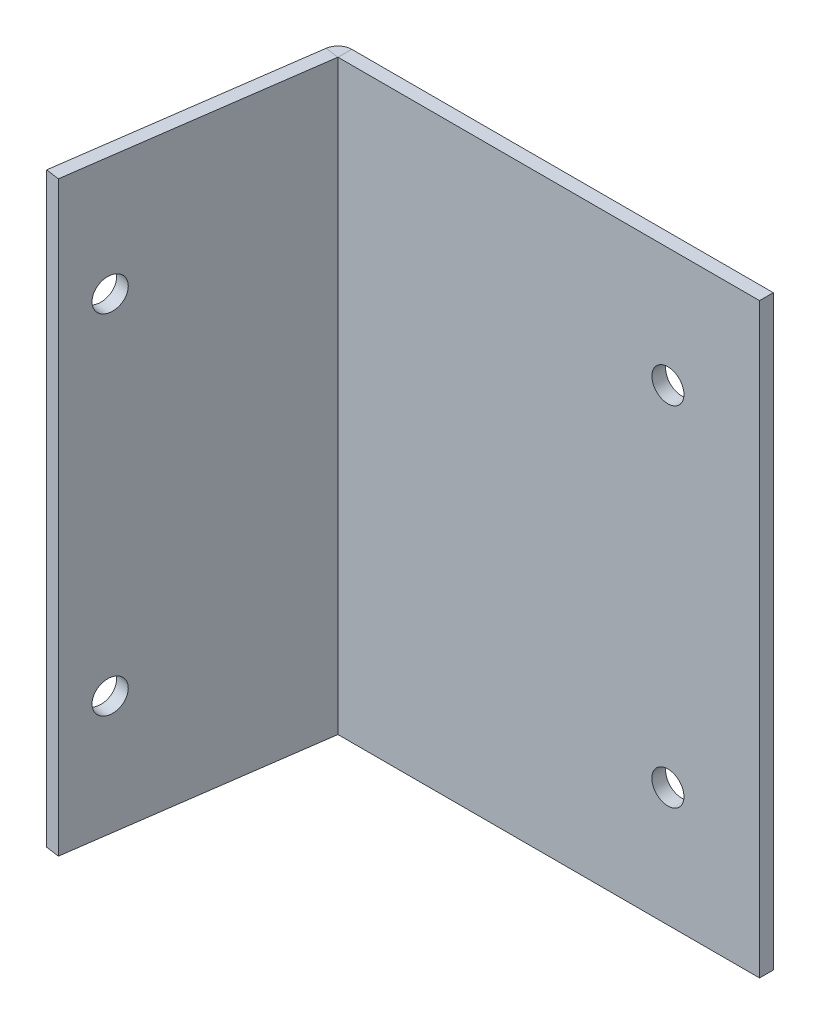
ISO-10303-21;
HEADER;
FILE_DESCRIPTION(('STEP AP214'),'2;1');
FILE_NAME('part.step','',(''),(''),'','','');
FILE_SCHEMA(('AUTOMOTIVE_DESIGN { 1 0 10303 214 1 1 1 1 }'));
ENDSEC;
DATA;
#1=APPLICATION_CONTEXT('core data for automotive mechanical design processes');
#2=APPLICATION_PROTOCOL_DEFINITION('international standard','automotive_design',2000,#1);
#3=PRODUCT_CONTEXT('',#1,'mechanical');
#4=PRODUCT('Part','Part','',(#3));
#5=PRODUCT_RELATED_PRODUCT_CATEGORY('part','',(#4));
#6=PRODUCT_DEFINITION_FORMATION('','',#4);
#7=PRODUCT_DEFINITION_CONTEXT('part definition',#1,'design');
#8=PRODUCT_DEFINITION('design','',#6,#7);
#9=PRODUCT_DEFINITION_SHAPE('','',#8);
#10=(LENGTH_UNIT() NAMED_UNIT(*) SI_UNIT(.MILLI.,.METRE.));
#11=(NAMED_UNIT(*) PLANE_ANGLE_UNIT() SI_UNIT($,.RADIAN.));
#12=(NAMED_UNIT(*) SI_UNIT($,.STERADIAN.) SOLID_ANGLE_UNIT());
#13=UNCERTAINTY_MEASURE_WITH_UNIT(LENGTH_MEASURE(1.E-05),#10,'distance_accuracy_value','');
#14=(GEOMETRIC_REPRESENTATION_CONTEXT(3) GLOBAL_UNCERTAINTY_ASSIGNED_CONTEXT((#13)) GLOBAL_UNIT_ASSIGNED_CONTEXT((#10,
#11,#12)) REPRESENTATION_CONTEXT('',''));
#15=CARTESIAN_POINT('',(0.,0.,0.));
#16=DIRECTION('',(0.,0.,1.));
#17=DIRECTION('',(1.,0.,0.));
#18=AXIS2_PLACEMENT_3D('',#15,#16,#17);
#19=CARTESIAN_POINT('',(21.7551854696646,64.,28.0299896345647));
#20=DIRECTION('',(-0.990268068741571,0.,-0.139173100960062));
#21=DIRECTION('',(-0.139173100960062,0.,0.990268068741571));
#22=AXIS2_PLACEMENT_3D('',#19,#20,#21);
#23=PLANE('',#22);
#24=CARTESIAN_POINT('',(22.4510509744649,51.,23.0786492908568));
#25=DIRECTION('',(0.990268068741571,0.,0.139173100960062));
#26=DIRECTION('',(0.139173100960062,0.,-0.990268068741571));
#27=AXIS2_PLACEMENT_3D('',#24,#25,#26);
#28=CIRCLE('',#27,1.75);
#29=CARTESIAN_POINT('',(22.694603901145,51.,21.345680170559));
#30=VERTEX_POINT('',#29);
#31=EDGE_CURVE('E175',#30,#30,#28,.T.);
#32=ORIENTED_EDGE('',*,*,#31,.T.);
#33=EDGE_LOOP('',(#32));
#34=FACE_BOUND('',#33,.T.);
#35=CARTESIAN_POINT('',(22.4510509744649,13.,23.0786492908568));
#36=DIRECTION('',(0.990268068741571,0.,0.139173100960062));
#37=DIRECTION('',(0.139173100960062,0.,-0.990268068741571));
#38=AXIS2_PLACEMENT_3D('',#35,#36,#37);
#39=CIRCLE('',#38,1.75);
#40=CARTESIAN_POINT('',(22.694603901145,13.,21.345680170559));
#41=VERTEX_POINT('',#40);
#42=EDGE_CURVE('E142',#41,#41,#39,.T.);
#43=ORIENTED_EDGE('',*,*,#42,.T.);
#44=EDGE_LOOP('',(#43));
#45=FACE_BOUND('',#44,.T.);
#46=DIRECTION('',(-0.139173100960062,0.,0.990268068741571));
#47=VECTOR('',#46,1.);
#48=CARTESIAN_POINT('',(21.7551854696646,64.,28.0299896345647));
#49=LINE('',#48,#47);
#50=CARTESIAN_POINT('',(25.5118617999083,64.,1.29984861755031));
#51=VERTEX_POINT('',#50);
#52=CARTESIAN_POINT('',(21.7551854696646,64.,28.0299896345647));
#53=VERTEX_POINT('',#52);
#54=EDGE_CURVE('E54',#51,#53,#49,.T.);
#55=ORIENTED_EDGE('',*,*,#54,.F.);
#56=DIRECTION('',(0.,-1.,0.));
#57=VECTOR('',#56,1.);
#58=CARTESIAN_POINT('',(25.5118617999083,64.,1.29984861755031));
#59=LINE('',#58,#57);
#60=CARTESIAN_POINT('',(25.5118617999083,0.,1.29984861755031));
#61=VERTEX_POINT('',#60);
#62=EDGE_CURVE('E46',#51,#61,#59,.T.);
#63=ORIENTED_EDGE('',*,*,#62,.T.);
#64=DIRECTION('',(0.139173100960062,0.,-0.990268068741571));
#65=VECTOR('',#64,1.);
#66=CARTESIAN_POINT('',(21.7551854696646,0.,28.0299896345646));
#67=LINE('',#66,#65);
#68=CARTESIAN_POINT('',(21.7551854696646,0.,28.0299896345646));
#69=VERTEX_POINT('',#68);
#70=EDGE_CURVE('E62',#69,#61,#67,.T.);
#71=ORIENTED_EDGE('',*,*,#70,.F.);
#72=DIRECTION('',(0.,-1.,0.));
#73=VECTOR('',#72,1.);
#74=CARTESIAN_POINT('',(21.7551854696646,0.,28.0299896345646));
#75=LINE('',#74,#73);
#76=EDGE_CURVE('E181',#53,#69,#75,.T.);
#77=ORIENTED_EDGE('',*,*,#76,.F.);
#78=EDGE_LOOP('',(#55,#63,#71,#77));
#79=FACE_BOUND('',#78,.T.);
#80=ADVANCED_FACE('F37',(#34,#45,#79),#23,.T.);
#81=CARTESIAN_POINT('',(23.2405875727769,64.,28.2387492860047));
#82=DIRECTION('',(-0.990268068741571,0.,-0.139173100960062));
#83=DIRECTION('',(-0.139173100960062,0.,0.990268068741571));
#84=AXIS2_PLACEMENT_3D('',#81,#82,#83);
#85=PLANE('',#84);
#86=DIRECTION('',(0.,-1.,0.));
#87=VECTOR('',#86,1.);
#88=CARTESIAN_POINT('',(26.9972639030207,64.,1.5086082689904));
#89=LINE('',#88,#87);
#90=CARTESIAN_POINT('',(26.9972639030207,64.,1.5086082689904));
#91=VERTEX_POINT('',#90);
#92=CARTESIAN_POINT('',(26.9972639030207,0.,1.5086082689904));
#93=VERTEX_POINT('',#92);
#94=EDGE_CURVE('E195',#91,#93,#89,.T.);
#95=ORIENTED_EDGE('',*,*,#94,.F.);
#96=DIRECTION('',(-0.139173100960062,0.,0.990268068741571));
#97=VECTOR('',#96,1.);
#98=CARTESIAN_POINT('',(23.2405875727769,64.,28.2387492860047));
#99=LINE('',#98,#97);
#100=CARTESIAN_POINT('',(23.2405875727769,64.,28.2387492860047));
#101=VERTEX_POINT('',#100);
#102=EDGE_CURVE('E41',#91,#101,#99,.T.);
#103=ORIENTED_EDGE('',*,*,#102,.T.);
#104=DIRECTION('',(0.,-1.,0.));
#105=VECTOR('',#104,1.);
#106=CARTESIAN_POINT('',(23.2405875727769,0.,28.2387492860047));
#107=LINE('',#106,#105);
#108=CARTESIAN_POINT('',(23.2405875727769,0.,28.2387492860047));
#109=VERTEX_POINT('',#108);
#110=EDGE_CURVE('E184',#101,#109,#107,.T.);
#111=ORIENTED_EDGE('',*,*,#110,.T.);
#112=DIRECTION('',(0.139173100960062,0.,-0.990268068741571));
#113=VECTOR('',#112,1.);
#114=CARTESIAN_POINT('',(23.2405875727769,0.,28.2387492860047));
#115=LINE('',#114,#113);
#116=EDGE_CURVE('E187',#109,#93,#115,.T.);
#117=ORIENTED_EDGE('',*,*,#116,.T.);
#118=EDGE_LOOP('',(#95,#103,#111,#117));
#119=FACE_BOUND('',#118,.T.);
#120=CARTESIAN_POINT('',(23.9364530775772,51.,23.2874089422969));
#121=DIRECTION('',(0.990268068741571,0.,0.139173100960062));
#122=DIRECTION('',(0.139173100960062,0.,-0.990268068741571));
#123=AXIS2_PLACEMENT_3D('',#120,#121,#122);
#124=CIRCLE('',#123,1.75);
#125=CARTESIAN_POINT('',(24.1800060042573,51.,21.5544398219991));
#126=VERTEX_POINT('',#125);
#127=EDGE_CURVE('E178',#126,#126,#124,.T.);
#128=ORIENTED_EDGE('',*,*,#127,.F.);
#129=EDGE_LOOP('',(#128));
#130=FACE_BOUND('',#129,.T.);
#131=CARTESIAN_POINT('',(23.9364530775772,13.,23.2874089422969));
#132=DIRECTION('',(0.990268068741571,0.,0.139173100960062));
#133=DIRECTION('',(0.139173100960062,0.,-0.990268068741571));
#134=AXIS2_PLACEMENT_3D('',#131,#132,#133);
#135=CIRCLE('',#134,1.75);
#136=CARTESIAN_POINT('',(24.1800060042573,13.,21.5544398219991));
#137=VERTEX_POINT('',#136);
#138=EDGE_CURVE('E172',#137,#137,#135,.T.);
#139=ORIENTED_EDGE('',*,*,#138,.F.);
#140=EDGE_LOOP('',(#139));
#141=FACE_BOUND('',#140,.T.);
#142=ADVANCED_FACE('F206',(#119,#130,#141),#85,.F.);
#143=CARTESIAN_POINT('',(23.2405875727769,0.,28.2387492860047));
#144=DIRECTION('',(0.139173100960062,0.,-0.990268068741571));
#145=DIRECTION('',(0.,1.,0.));
#146=AXIS2_PLACEMENT_3D('',#143,#144,#145);
#147=PLANE('',#146);
#148=ORIENTED_EDGE('',*,*,#76,.T.);
#149=DIRECTION('',(-0.990268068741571,0.,-0.139173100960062));
#150=VECTOR('',#149,1.);
#151=CARTESIAN_POINT('',(23.2405875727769,0.,28.2387492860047));
#152=LINE('',#151,#150);
#153=EDGE_CURVE('E193',#109,#69,#152,.T.);
#154=ORIENTED_EDGE('',*,*,#153,.F.);
#155=ORIENTED_EDGE('',*,*,#110,.F.);
#156=DIRECTION('',(-0.990268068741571,0.,-0.139173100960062));
#157=VECTOR('',#156,1.);
#158=CARTESIAN_POINT('',(23.2405875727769,64.,28.2387492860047));
#159=LINE('',#158,#157);
#160=EDGE_CURVE('E190',#101,#53,#159,.T.);
#161=ORIENTED_EDGE('',*,*,#160,.T.);
#162=EDGE_LOOP('',(#148,#154,#155,#161));
#163=FACE_BOUND('',#162,.T.);
#164=ADVANCED_FACE('F212',(#163),#147,.F.);
#165=CARTESIAN_POINT('',(23.2405875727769,0.,28.2387492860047));
#166=DIRECTION('',(0.,1.,0.));
#167=DIRECTION('',(0.990268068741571,0.,0.139173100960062));
#168=AXIS2_PLACEMENT_3D('',#165,#166,#167);
#169=PLANE('',#168);
#170=DIRECTION('',(-0.990268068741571,0.,-0.139173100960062));
#171=VECTOR('',#170,1.);
#172=CARTESIAN_POINT('',(26.9972639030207,0.,1.5086082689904));
#173=LINE('',#172,#171);
#174=EDGE_CURVE('E197',#93,#61,#173,.T.);
#175=ORIENTED_EDGE('',*,*,#174,.F.);
#176=ORIENTED_EDGE('',*,*,#116,.F.);
#177=ORIENTED_EDGE('',*,*,#153,.T.);
#178=ORIENTED_EDGE('',*,*,#70,.T.);
#179=EDGE_LOOP('',(#175,#176,#177,#178));
#180=FACE_BOUND('',#179,.T.);
#181=ADVANCED_FACE('F213',(#180),#169,.F.);
#182=CARTESIAN_POINT('',(23.2405875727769,64.,28.2387492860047));
#183=DIRECTION('',(0.,-1.,0.));
#184=DIRECTION('',(-0.990268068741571,0.,-0.139173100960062));
#185=AXIS2_PLACEMENT_3D('',#182,#183,#184);
#186=PLANE('',#185);
#187=DIRECTION('',(0.990268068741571,0.,0.139173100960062));
#188=VECTOR('',#187,1.);
#189=CARTESIAN_POINT('',(26.9972639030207,64.,1.5086082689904));
#190=LINE('',#189,#188);
#191=EDGE_CURVE('E12',#51,#91,#190,.T.);
#192=ORIENTED_EDGE('',*,*,#191,.F.);
#193=ORIENTED_EDGE('',*,*,#54,.T.);
#194=ORIENTED_EDGE('',*,*,#160,.F.);
#195=ORIENTED_EDGE('',*,*,#102,.F.);
#196=EDGE_LOOP('',(#192,#193,#194,#195));
#197=FACE_BOUND('',#196,.T.);
#198=ADVANCED_FACE('F39',(#197),#186,.F.);
#199=CARTESIAN_POINT('',(23.9364530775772,51.,23.2874089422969));
#200=DIRECTION('',(-0.990268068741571,0.,-0.139173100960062));
#201=DIRECTION('',(-0.139173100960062,0.,0.990268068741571));
#202=AXIS2_PLACEMENT_3D('',#199,#200,#201);
#203=CYLINDRICAL_SURFACE('',#202,1.75);
#204=ORIENTED_EDGE('',*,*,#127,.T.);
#205=EDGE_LOOP('',(#204));
#206=FACE_BOUND('',#205,.T.);
#207=ORIENTED_EDGE('',*,*,#31,.F.);
#208=EDGE_LOOP('',(#207));
#209=FACE_BOUND('',#208,.T.);
#210=ADVANCED_FACE('F245',(#206,#209),#203,.F.);
#211=CARTESIAN_POINT('',(23.9364530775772,13.,23.2874089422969));
#212=DIRECTION('',(-0.990268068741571,0.,-0.139173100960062));
#213=DIRECTION('',(-0.139173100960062,0.,0.990268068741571));
#214=AXIS2_PLACEMENT_3D('',#211,#212,#213);
#215=CYLINDRICAL_SURFACE('',#214,1.75);
#216=ORIENTED_EDGE('',*,*,#138,.T.);
#217=EDGE_LOOP('',(#216));
#218=FACE_BOUND('',#217,.T.);
#219=ORIENTED_EDGE('',*,*,#42,.F.);
#220=EDGE_LOOP('',(#219));
#221=FACE_BOUND('',#220,.T.);
#222=ADVANCED_FACE('F236',(#218,#221),#215,.F.);
#223=CARTESIAN_POINT('',(73.,0.,1.5));
#224=DIRECTION('',(-1.,0.,0.));
#225=DIRECTION('',(0.,-1.,0.));
#226=AXIS2_PLACEMENT_3D('',#223,#224,#225);
#227=PLANE('',#226);
#228=DIRECTION('',(0.,1.,0.));
#229=VECTOR('',#228,1.);
#230=CARTESIAN_POINT('',(73.,0.,0.));
#231=LINE('',#230,#229);
#232=CARTESIAN_POINT('',(73.,0.,0.));
#233=VERTEX_POINT('',#232);
#234=CARTESIAN_POINT('',(73.,64.,0.));
#235=VERTEX_POINT('',#234);
#236=EDGE_CURVE('E168',#233,#235,#231,.T.);
#237=ORIENTED_EDGE('',*,*,#236,.T.);
#238=DIRECTION('',(0.,0.,-1.));
#239=VECTOR('',#238,1.);
#240=CARTESIAN_POINT('',(73.,64.,1.5));
#241=LINE('',#240,#239);
#242=CARTESIAN_POINT('',(73.,64.,1.5));
#243=VERTEX_POINT('',#242);
#244=EDGE_CURVE('E140',#243,#235,#241,.T.);
#245=ORIENTED_EDGE('',*,*,#244,.F.);
#246=DIRECTION('',(0.,1.,0.));
#247=VECTOR('',#246,1.);
#248=CARTESIAN_POINT('',(73.,0.,1.5));
#249=LINE('',#248,#247);
#250=CARTESIAN_POINT('',(73.,0.,1.5));
#251=VERTEX_POINT('',#250);
#252=EDGE_CURVE('E129',#251,#243,#249,.T.);
#253=ORIENTED_EDGE('',*,*,#252,.F.);
#254=DIRECTION('',(0.,0.,-1.));
#255=VECTOR('',#254,1.);
#256=CARTESIAN_POINT('',(73.,0.,1.5));
#257=LINE('',#256,#255);
#258=EDGE_CURVE('E165',#251,#233,#257,.T.);
#259=ORIENTED_EDGE('',*,*,#258,.T.);
#260=EDGE_LOOP('',(#237,#245,#253,#259));
#261=FACE_BOUND('',#260,.T.);
#262=ADVANCED_FACE('F233',(#261),#227,.F.);
#263=CARTESIAN_POINT('',(63.,51.,1.5));
#264=DIRECTION('',(0.,0.,-1.));
#265=DIRECTION('',(-1.,0.,0.));
#266=AXIS2_PLACEMENT_3D('',#263,#264,#265);
#267=CYLINDRICAL_SURFACE('',#266,1.75);
#268=CARTESIAN_POINT('',(63.,51.,1.5));
#269=DIRECTION('',(0.,0.,1.));
#270=DIRECTION('',(1.,0.,0.));
#271=AXIS2_PLACEMENT_3D('',#268,#269,#270);
#272=CIRCLE('',#271,1.75);
#273=CARTESIAN_POINT('',(64.75,51.,1.5));
#274=VERTEX_POINT('',#273);
#275=EDGE_CURVE('E162',#274,#274,#272,.T.);
#276=ORIENTED_EDGE('',*,*,#275,.T.);
#277=EDGE_LOOP('',(#276));
#278=FACE_BOUND('',#277,.T.);
#279=CARTESIAN_POINT('',(63.,51.,0.));
#280=DIRECTION('',(0.,0.,1.));
#281=DIRECTION('',(1.,0.,0.));
#282=AXIS2_PLACEMENT_3D('',#279,#280,#281);
#283=CIRCLE('',#282,1.75);
#284=CARTESIAN_POINT('',(64.75,51.,0.));
#285=VERTEX_POINT('',#284);
#286=EDGE_CURVE('E150',#285,#285,#283,.T.);
#287=ORIENTED_EDGE('',*,*,#286,.F.);
#288=EDGE_LOOP('',(#287));
#289=FACE_BOUND('',#288,.T.);
#290=ADVANCED_FACE('F235',(#278,#289),#267,.F.);
#291=CARTESIAN_POINT('',(63.,13.,1.5));
#292=DIRECTION('',(0.,0.,-1.));
#293=DIRECTION('',(-1.,0.,0.));
#294=AXIS2_PLACEMENT_3D('',#291,#292,#293);
#295=CYLINDRICAL_SURFACE('',#294,1.75);
#296=CARTESIAN_POINT('',(63.,13.,1.5));
#297=DIRECTION('',(0.,0.,1.));
#298=DIRECTION('',(1.,0.,0.));
#299=AXIS2_PLACEMENT_3D('',#296,#297,#298);
#300=CIRCLE('',#299,1.75);
#301=CARTESIAN_POINT('',(64.75,13.,1.5));
#302=VERTEX_POINT('',#301);
#303=EDGE_CURVE('E133',#302,#302,#300,.T.);
#304=ORIENTED_EDGE('',*,*,#303,.T.);
#305=EDGE_LOOP('',(#304));
#306=FACE_BOUND('',#305,.T.);
#307=CARTESIAN_POINT('',(63.,13.,0.));
#308=DIRECTION('',(0.,0.,1.));
#309=DIRECTION('',(1.,0.,0.));
#310=AXIS2_PLACEMENT_3D('',#307,#308,#309);
#311=CIRCLE('',#310,1.75);
#312=CARTESIAN_POINT('',(64.75,13.,0.));
#313=VERTEX_POINT('',#312);
#314=EDGE_CURVE('E144',#313,#313,#311,.T.);
#315=ORIENTED_EDGE('',*,*,#314,.F.);
#316=EDGE_LOOP('',(#315));
#317=FACE_BOUND('',#316,.T.);
#318=ADVANCED_FACE('F242',(#306,#317),#295,.F.);
#319=CARTESIAN_POINT('',(0.,64.,1.5));
#320=DIRECTION('',(0.,0.,-1.));
#321=DIRECTION('',(-1.,0.,0.));
#322=AXIS2_PLACEMENT_3D('',#319,#320,#321);
#323=PLANE('',#322);
#324=ORIENTED_EDGE('',*,*,#303,.F.);
#325=EDGE_LOOP('',(#324));
#326=FACE_BOUND('',#325,.T.);
#327=ORIENTED_EDGE('',*,*,#275,.F.);
#328=EDGE_LOOP('',(#327));
#329=FACE_BOUND('',#328,.T.);
#330=DIRECTION('',(-1.,0.,0.));
#331=VECTOR('',#330,1.);
#332=CARTESIAN_POINT('',(0.,64.,1.5));
#333=LINE('',#332,#331);
#334=CARTESIAN_POINT('',(27.0071665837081,64.,1.5));
#335=VERTEX_POINT('',#334);
#336=EDGE_CURVE('E124',#243,#335,#333,.T.);
#337=ORIENTED_EDGE('',*,*,#336,.T.);
#338=DIRECTION('',(0.,-1.,0.));
#339=VECTOR('',#338,1.);
#340=CARTESIAN_POINT('',(27.0071665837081,64.,1.5));
#341=LINE('',#340,#339);
#342=CARTESIAN_POINT('',(27.0071665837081,0.,1.5));
#343=VERTEX_POINT('',#342);
#344=EDGE_CURVE('E117',#335,#343,#341,.T.);
#345=ORIENTED_EDGE('',*,*,#344,.T.);
#346=DIRECTION('',(1.,0.,0.));
#347=VECTOR('',#346,1.);
#348=CARTESIAN_POINT('',(0.,0.,1.5));
#349=LINE('',#348,#347);
#350=EDGE_CURVE('E123',#343,#251,#349,.T.);
#351=ORIENTED_EDGE('',*,*,#350,.T.);
#352=ORIENTED_EDGE('',*,*,#252,.T.);
#353=EDGE_LOOP('',(#337,#345,#351,#352));
#354=FACE_BOUND('',#353,.T.);
#355=ADVANCED_FACE('F127',(#326,#329,#354),#323,.F.);
#356=CARTESIAN_POINT('',(0.,0.,1.5));
#357=DIRECTION('',(0.,1.,0.));
#358=DIRECTION('',(0.,0.,1.));
#359=AXIS2_PLACEMENT_3D('',#356,#357,#358);
#360=PLANE('',#359);
#361=ORIENTED_EDGE('',*,*,#350,.F.);
#362=DIRECTION('',(0.,0.,-1.));
#363=VECTOR('',#362,1.);
#364=CARTESIAN_POINT('',(27.0071665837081,0.,1.5));
#365=LINE('',#364,#363);
#366=CARTESIAN_POINT('',(27.0071665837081,0.,0.));
#367=VERTEX_POINT('',#366);
#368=EDGE_CURVE('E155',#343,#367,#365,.T.);
#369=ORIENTED_EDGE('',*,*,#368,.T.);
#370=DIRECTION('',(1.,0.,0.));
#371=VECTOR('',#370,1.);
#372=CARTESIAN_POINT('',(0.,0.,0.));
#373=LINE('',#372,#371);
#374=EDGE_CURVE('E153',#367,#233,#373,.T.);
#375=ORIENTED_EDGE('',*,*,#374,.T.);
#376=ORIENTED_EDGE('',*,*,#258,.F.);
#377=EDGE_LOOP('',(#361,#369,#375,#376));
#378=FACE_BOUND('',#377,.T.);
#379=ADVANCED_FACE('F231',(#378),#360,.F.);
#380=CARTESIAN_POINT('',(0.,64.,0.));
#381=DIRECTION('',(0.,0.,-1.));
#382=DIRECTION('',(-1.,0.,0.));
#383=AXIS2_PLACEMENT_3D('',#380,#381,#382);
#384=PLANE('',#383);
#385=DIRECTION('',(0.,-1.,0.));
#386=VECTOR('',#385,1.);
#387=CARTESIAN_POINT('',(27.0071665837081,64.,0.));
#388=LINE('',#387,#386);
#389=CARTESIAN_POINT('',(27.0071665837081,64.,0.));
#390=VERTEX_POINT('',#389);
#391=EDGE_CURVE('E170',#390,#367,#388,.T.);
#392=ORIENTED_EDGE('',*,*,#391,.F.);
#393=DIRECTION('',(-1.,0.,0.));
#394=VECTOR('',#393,1.);
#395=CARTESIAN_POINT('',(0.,64.,0.));
#396=LINE('',#395,#394);
#397=EDGE_CURVE('E138',#235,#390,#396,.T.);
#398=ORIENTED_EDGE('',*,*,#397,.F.);
#399=ORIENTED_EDGE('',*,*,#236,.F.);
#400=ORIENTED_EDGE('',*,*,#374,.F.);
#401=EDGE_LOOP('',(#392,#398,#399,#400));
#402=FACE_BOUND('',#401,.T.);
#403=ORIENTED_EDGE('',*,*,#286,.T.);
#404=EDGE_LOOP('',(#403));
#405=FACE_BOUND('',#404,.T.);
#406=ORIENTED_EDGE('',*,*,#314,.T.);
#407=EDGE_LOOP('',(#406));
#408=FACE_BOUND('',#407,.T.);
#409=ADVANCED_FACE('F226',(#402,#405,#408),#384,.T.);
#410=CARTESIAN_POINT('',(0.,64.,1.5));
#411=DIRECTION('',(0.,-1.,0.));
#412=DIRECTION('',(0.,0.,-1.));
#413=AXIS2_PLACEMENT_3D('',#410,#411,#412);
#414=PLANE('',#413);
#415=ORIENTED_EDGE('',*,*,#397,.T.);
#416=DIRECTION('',(0.,0.,1.));
#417=VECTOR('',#416,1.);
#418=CARTESIAN_POINT('',(27.0071665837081,64.,1.5));
#419=LINE('',#418,#417);
#420=EDGE_CURVE('E108',#390,#335,#419,.T.);
#421=ORIENTED_EDGE('',*,*,#420,.T.);
#422=ORIENTED_EDGE('',*,*,#336,.F.);
#423=ORIENTED_EDGE('',*,*,#244,.T.);
#424=EDGE_LOOP('',(#415,#421,#422,#423));
#425=FACE_BOUND('',#424,.T.);
#426=ADVANCED_FACE('F136',(#425),#414,.F.);
#427=CARTESIAN_POINT('',(27.0071665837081,64.,1.51));
#428=DIRECTION('',(0.,-1.,0.));
#429=DIRECTION('',(0.,0.,-1.));
#430=AXIS2_PLACEMENT_3D('',#427,#428,#429);
#431=PLANE('',#430);
#432=ORIENTED_EDGE('',*,*,#420,.F.);
#433=CARTESIAN_POINT('',(27.0071665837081,64.,1.51));
#434=DIRECTION('',(0.,-1.,0.));
#435=DIRECTION('',(0.,0.,-1.));
#436=AXIS2_PLACEMENT_3D('',#433,#434,#435);
#437=CIRCLE('',#436,1.51);
#438=EDGE_CURVE('E222',#390,#51,#437,.F.);
#439=ORIENTED_EDGE('',*,*,#438,.T.);
#440=ORIENTED_EDGE('',*,*,#191,.T.);
#441=CARTESIAN_POINT('',(27.0071665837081,64.,1.51));
#442=DIRECTION('',(0.,1.,0.));
#443=DIRECTION('',(0.,0.,1.));
#444=AXIS2_PLACEMENT_3D('',#441,#442,#443);
#445=CIRCLE('',#444,0.00999999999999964);
#446=EDGE_CURVE('E103',#335,#91,#445,.T.);
#447=ORIENTED_EDGE('',*,*,#446,.F.);
#448=EDGE_LOOP('',(#432,#439,#440,#447));
#449=FACE_BOUND('',#448,.T.);
#450=ADVANCED_FACE('F105',(#449),#431,.F.);
#451=CARTESIAN_POINT('',(27.0071665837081,0.,1.51));
#452=DIRECTION('',(0.,1.,0.));
#453=DIRECTION('',(0.,0.,1.));
#454=AXIS2_PLACEMENT_3D('',#451,#452,#453);
#455=PLANE('',#454);
#456=ORIENTED_EDGE('',*,*,#174,.T.);
#457=CARTESIAN_POINT('',(27.0071665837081,0.,1.51));
#458=DIRECTION('',(0.,-1.,0.));
#459=DIRECTION('',(0.,0.,-1.));
#460=AXIS2_PLACEMENT_3D('',#457,#458,#459);
#461=CIRCLE('',#460,1.51);
#462=EDGE_CURVE('E113',#61,#367,#461,.T.);
#463=ORIENTED_EDGE('',*,*,#462,.T.);
#464=ORIENTED_EDGE('',*,*,#368,.F.);
#465=CARTESIAN_POINT('',(27.0071665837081,0.,1.51));
#466=DIRECTION('',(0.,-1.,0.));
#467=DIRECTION('',(0.,0.,-1.));
#468=AXIS2_PLACEMENT_3D('',#465,#466,#467);
#469=CIRCLE('',#468,0.00999999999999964);
#470=EDGE_CURVE('E112',#93,#343,#469,.T.);
#471=ORIENTED_EDGE('',*,*,#470,.F.);
#472=EDGE_LOOP('',(#456,#463,#464,#471));
#473=FACE_BOUND('',#472,.T.);
#474=ADVANCED_FACE('F217',(#473),#455,.F.);
#475=CARTESIAN_POINT('',(27.0071665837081,96.0175773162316,1.51));
#476=DIRECTION('',(0.,-1.,0.));
#477=DIRECTION('',(0.,0.,-1.));
#478=AXIS2_PLACEMENT_3D('',#475,#476,#477);
#479=CYLINDRICAL_SURFACE('',#478,0.01);
#480=ORIENTED_EDGE('',*,*,#470,.T.);
#481=ORIENTED_EDGE('',*,*,#344,.F.);
#482=ORIENTED_EDGE('',*,*,#446,.T.);
#483=ORIENTED_EDGE('',*,*,#94,.T.);
#484=EDGE_LOOP('',(#480,#481,#482,#483));
#485=FACE_BOUND('',#484,.T.);
#486=ADVANCED_FACE('F119',(#485),#479,.F.);
#487=CARTESIAN_POINT('',(27.0071665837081,96.0175773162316,1.51));
#488=DIRECTION('',(0.,-1.,0.));
#489=DIRECTION('',(0.,0.,-1.));
#490=AXIS2_PLACEMENT_3D('',#487,#488,#489);
#491=CYLINDRICAL_SURFACE('',#490,1.51);
#492=ORIENTED_EDGE('',*,*,#462,.F.);
#493=ORIENTED_EDGE('',*,*,#62,.F.);
#494=ORIENTED_EDGE('',*,*,#438,.F.);
#495=ORIENTED_EDGE('',*,*,#391,.T.);
#496=EDGE_LOOP('',(#492,#493,#494,#495));
#497=FACE_BOUND('',#496,.T.);
#498=ADVANCED_FACE('F221',(#497),#491,.T.);
#499=CLOSED_SHELL('',(#80,#142,#164,#181,#198,#210,#222,#262,#290,#318,#355,#379,#409,#426,#450,
#474,#486,#498));
#500=MANIFOLD_SOLID_BREP('B2',#499);
#501=ADVANCED_BREP_SHAPE_REPRESENTATION('',(#18,#500),#14);
#502=SHAPE_DEFINITION_REPRESENTATION(#9,#501);
ENDSEC;
END-ISO-10303-21;
